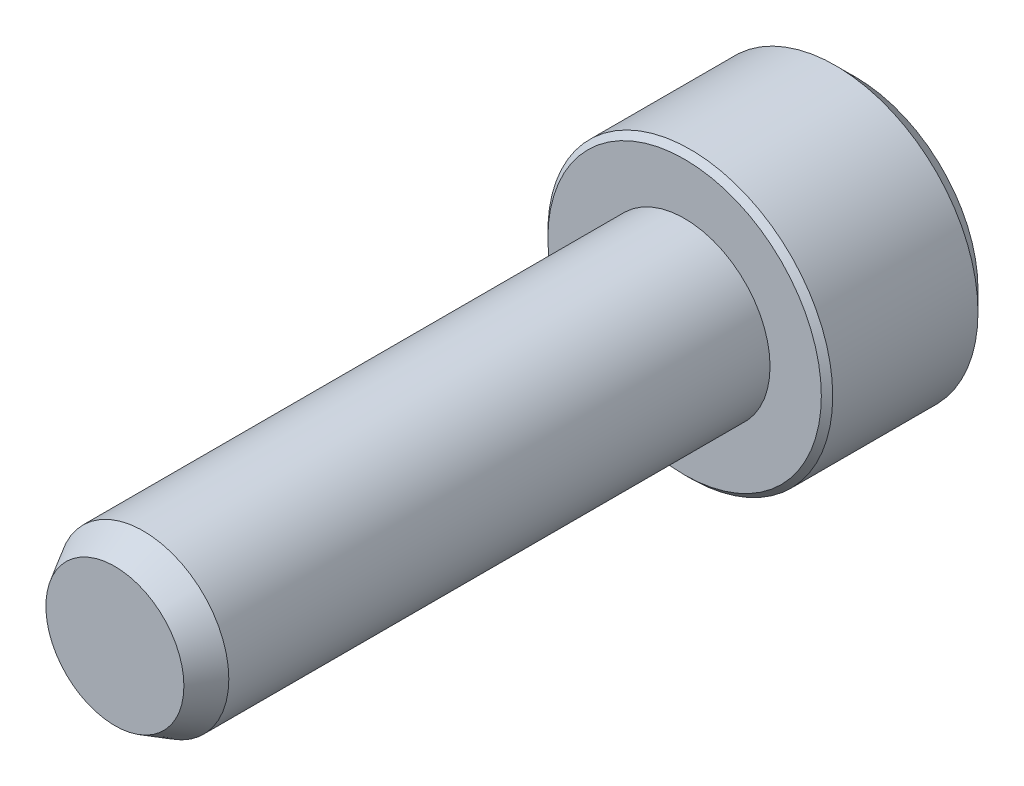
from build123d import *

# Parameters (mm, degrees)
ESQUISSE1_R             = 3
BASE_EXTRUSION_DEPTH    = 20
ESQUISSE2_R             = 5
BOSS_EXTRU_1_DEPTH      = 6
ENL_V_MAT_EXTRU_1_DEPTH = 3
CHANFREIN1_SIZE         = 0.7
CHANFREIN2_SIZE         = 1
CHANFREIN2_SIZE2        = 0.577350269
CHANFREIN3_SIZE         = 0.2


with BuildPart() as part:
    # Esquisse1 → Base-Extrusion (new body)
    with BuildSketch(Plane.XY):
        Circle(ESQUISSE1_R)
    extrude(amount=BASE_EXTRUSION_DEPTH)

    # Esquisse2 → Boss.-Extru.1 (add)
    with BuildSketch(Plane.XY):
        Circle(ESQUISSE2_R)
    extrude(amount=-BOSS_EXTRU_1_DEPTH)

    # Esquisse3 → Enl_v. mat.-Extru.1 (cut)
    with BuildSketch(Plane.XY.offset(-6)):
        Polygon((-1.443375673, 2.5), (1.443375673, 2.5), (2.886751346, 0), (1.443375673, -2.5), (-1.443375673, -2.5), (-2.886751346, 0), align=None)
    extrude(amount=ENL_V_MAT_EXTRU_1_DEPTH, mode=Mode.SUBTRACT)

    # Chanfrein1
    chanfrein1_edges = [part.edges().sort_by_distance(p)[0] for p in [
        (-5, 0, -6),
    ]]
    chamfer(chanfrein1_edges, length=CHANFREIN1_SIZE)

    # Chanfrein2
    chanfrein2_edges = [part.edges().sort_by_distance(p)[0] for p in [
        (-3, 0, 20),
    ]]
    chanfrein2_side = [part.faces().sort_by_distance(p)[0] for p in [
        (-3, 0, 10),
    ]]
    chamfer(chanfrein2_edges, length=CHANFREIN2_SIZE, length2=CHANFREIN2_SIZE2, reference=chanfrein2_side[0])

    # Chanfrein3
    chanfrein3_edges = [part.edges().sort_by_distance(p)[0] for p in [
        (-5, 0, 0),
    ]]
    chamfer(chanfrein3_edges, length=CHANFREIN3_SIZE)


solid = part.part
